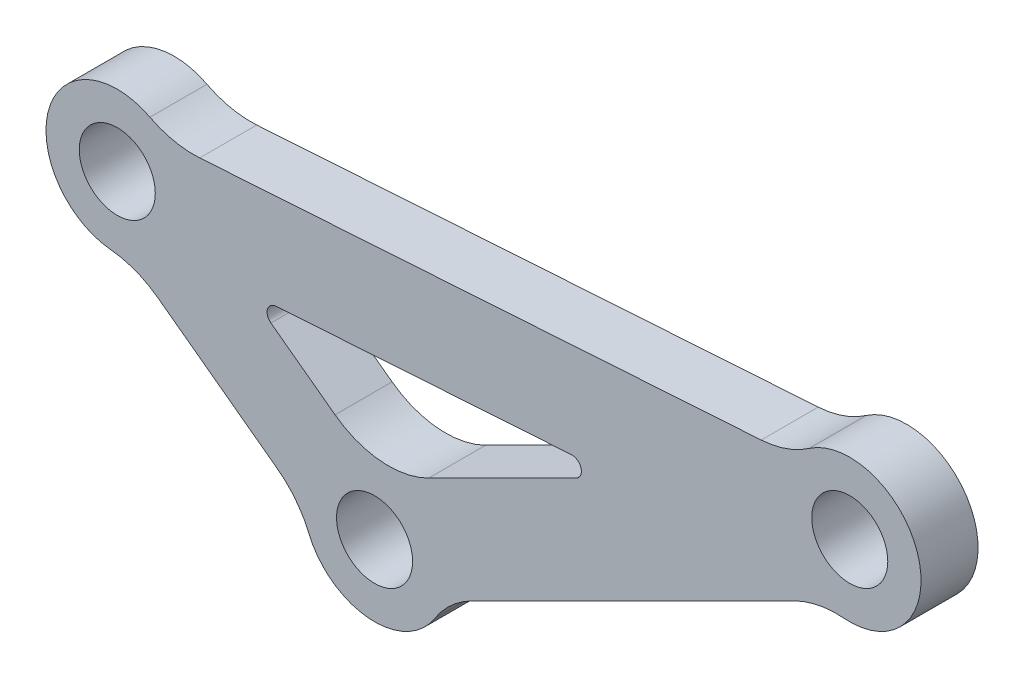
from build123d import *

# Parameters (mm, degrees)
CROQUIS2_R              = 4
SALIENTE_EXTRUIR1_DEPTH = 3


with BuildPart() as part:
    # Croquis2 → Saliente-Extruir1 (new, symmetric)
    with BuildSketch(Plane.XY):
        with BuildLine():
            Line((-18.399794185, 25.573061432), (40.681335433, 29.405960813))
            ThreePointArc((40.681335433, 29.405960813), (43.324791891, 29.941979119), (45.728833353, 31.164992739))
            ThreePointArc((45.728833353, 31.164992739), (57.239731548, 26.958644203), (49.419691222, 17.522484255))
            ThreePointArc((49.419691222, 17.522484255), (46.726945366, 17.366607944), (44.173810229, 16.496735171))
            Line((44.173810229, 16.496735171), (10.298325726, -0.441007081))
            ThreePointArc((10.298325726, -0.441007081), (8.070546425, -1.961591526), (6.330197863, -4.022262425))
            ThreePointArc((6.330197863, -4.022262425), (-0.646612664, -7.472074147), (-6.927069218, -2.875015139))
            ThreePointArc((-6.927069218, -2.875015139), (-8.287547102, -0.546007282), (-10.220989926, 1.334677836))
            Line((-10.220989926, 1.334677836), (-22.792249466, 10.622275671))
            ThreePointArc((-22.792249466, 10.622275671), (-25.157995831, 11.917814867), (-27.783933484, 12.533955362))
            ThreePointArc((-27.783933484, 12.533955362), (-34.266938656, 22.114105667), (-23.632260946, 26.665178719))
            ThreePointArc((-23.632260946, 26.665178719), (-21.090349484, 25.763034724), (-18.399794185, 25.573061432))
        make_face()
        Circle(CROQUIS2_R, mode=Mode.SUBTRACT)
        with Locations((50, 25)):
            Circle(CROQUIS2_R, mode=Mode.SUBTRACT)
        with Locations((-27.07106781, 20)):
            Circle(CROQUIS2_R, mode=Mode.SUBTRACT)
        with BuildLine():
            Line((-10.901624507, 14.270627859), (-4.155930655, 9.28693538))
            ThreePointArc((-4.155930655, 9.28693538), (0.646612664, 7.472074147), (5.689532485, 8.434936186))
            Line((5.689532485, 8.434936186), (21.212344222, 16.196342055))
            ThreePointArc((21.212344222, 16.196342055), (21.730428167, 17.351921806), (20.700391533, 18.08867147))
            Line((20.700391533, 18.08867147), (-10.372146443, 16.072834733))
            ThreePointArc((-10.372146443, 16.072834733), (-11.266856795, 15.356813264), (-10.901624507, 14.270627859))
        make_face(mode=Mode.SUBTRACT)
    extrude(amount=SALIENTE_EXTRUIR1_DEPTH, both=True)


solid = part.part
